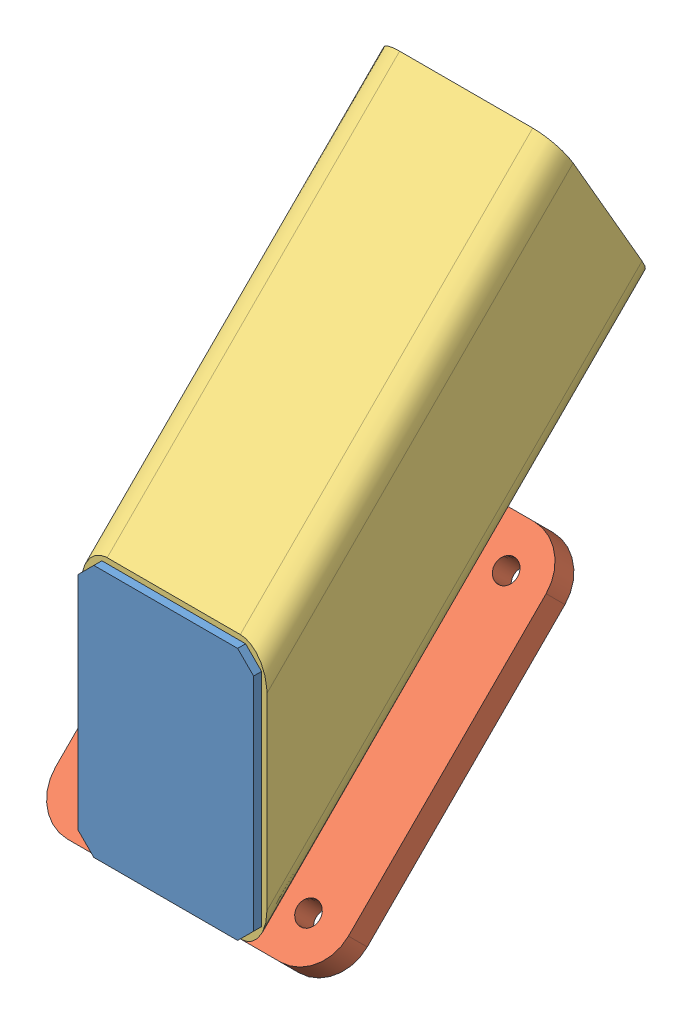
SolidWorks assembly Extremité chariot.SLDASM, configuration Défaut (file format 5000). Lengths in mm.
Overall size (110 215.89 208.82).
3 component instances, 3 part files, 6 mates.
Components (placement in the parent):
- Bouchon chariot 95 x 66 x 3-1: Bouchon chariot 95 x 66 x 3.SLDPRT [Défaut] at origin size (66 95 3)
- Platine chariot 140 x 115 x 10-1: Platine chariot 140 x 115 x 10.SLDPRT [Défaut] at (0 -8.8363 -54.8008) x (0 0.707107 -0.707107) z (0 0.707107 0.707107) size (135 110 10)
- Tube carré chariot 70 x 70 x 5 x 225.3-1: Tube carré chariot 70 x 70 x 5 x 225.3.SLDPRT [Défaut] at (0 134.5801 -134.5776) x (1 0 0) z (0 -0.707107 0.707107) size (70 70 225.32)
Mates (geometry in assembly coordinates):
- Coïncidente25: coincident: plane of Bouchon chariot 95 x 66 x 3-1 through (0 0 0) normal (0 0 -1); plane of Tube carré chariot 70 x 70 x 5 x 225.3-1 through (215 -49.4949 0) normal (0 0 1)
- Distance4: distance = 2 mm: line of Bouchon chariot 95 x 66 x 3-1 through (27 47.5 0) axis (-1 0 0); line of Tube carré chariot 70 x 70 x 5 x 225.3-1 through (25 49.5 0) axis (-1 0 0)
- Distance5: distance = 2 mm: line of Bouchon chariot 95 x 66 x 3-1 through (-33 41.5 0) axis (0 -1 0); line of Tube carré chariot 70 x 70 x 5 x 225.3-1 through (-35 35.3579 0) axis (0 -1 0)
- Coïncidente26: coincident: plane of Platine chariot 140 x 115 x 10-1 through (0 -1.7652 -47.7297) normal (0 0.707107 0.707107); plane of Tube carré chariot 70 x 70 x 5 x 225.3-1 through (-25 -52.8032 3.3082) normal (0 -0.707107 -0.707107)
- Coïncidente27: coincident: plane of Platine chariot 140 x 115 x 10-1; plane of Tube carré chariot 70 x 70 x 5 x 225.3-1
- Coïncidente28: coincident: plane of Platine chariot 140 x 115 x 10-1 through (-55 -49.4949 0) normal (0 -0.707107 0.707107); line of Tube carré chariot 70 x 70 x 5 x 225.3-1 through (25 -49.4949 0) axis (-1 0 0)
